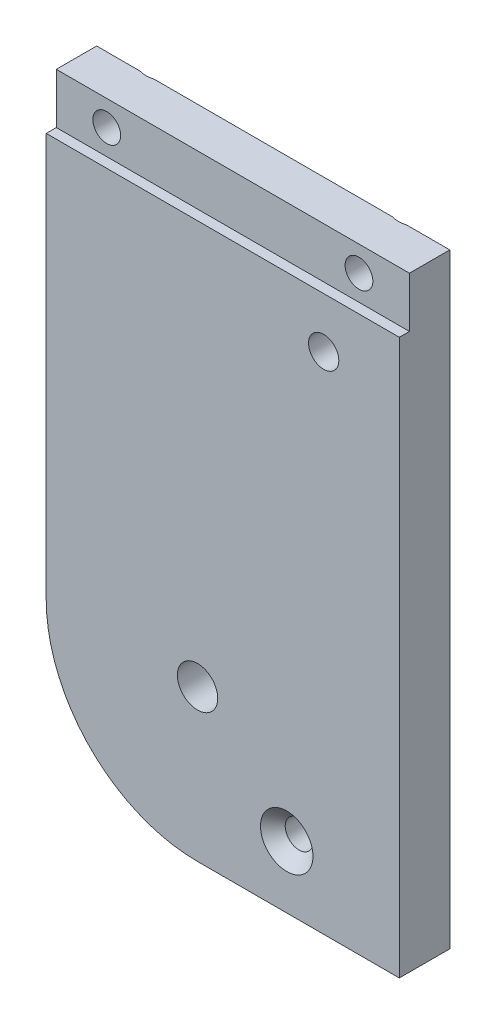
from build123d import *

# Parameters (mm, degrees)
ESQUISSE1_R                                    = 4
BOSS_EXTRU_1_DEPTH                             = 10
ESQUISSE2_W                                    = 2
ESQUISSE2_H                                    = 10
ENL_V_MAT_EXTRU_1_DEPTH                        = 153.397506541
ESQUISSE3_R                                    = 3
ENL_V_MAT_EXTRU_2_DEPTH                        = 158.241851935
FRAISAGE_POUR_VIS_T_TE_FRAIS_E_M51_D           = 5.5
FRAISAGE_POUR_VIS_T_TE_FRAIS_E_M51_CSINK_D     = 10.4
FRAISAGE_POUR_VIS_T_TE_FRAIS_E_M51_CSINK_ANGLE = 90
FRAISAGE_POUR_VIS_T_TE_FRAIS_E_M52_D           = 5.5
FRAISAGE_POUR_VIS_T_TE_FRAIS_E_M52_CSINK_D     = 10.4
FRAISAGE_POUR_VIS_T_TE_FRAIS_E_M52_CSINK_ANGLE = 90


with BuildPart() as part:
    # Esquisse1 → Boss.-Extru.1 (new body)
    with BuildSketch(Plane.XY):
        with BuildLine():
            Line((-80, 135), (-10, 135))
            Line((-10, 135), (-10, 15))
            Line((-10, 15), (-50, 15))
            ThreePointArc((-50, 15), (-71.213203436, 23.786796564), (-80, 45))
            Line((-80, 45), (-80, 135))
        make_face()
        with Locations((-50, 45)):
            Circle(ESQUISSE1_R, mode=Mode.SUBTRACT)
    extrude(amount=BOSS_EXTRU_1_DEPTH)

    # Esquisse2 → Enl_v. mat.-Extru.1 (cut, through all)
    with BuildSketch(Plane(origin=(-10, 0, 0), x_dir=(0, 0, -1), z_dir=(1, 0, 0))):
        with Locations((-9, 130)):
            Rectangle(ESQUISSE2_W, ESQUISSE2_H)
    extrude(amount=-ENL_V_MAT_EXTRU_1_DEPTH, mode=Mode.SUBTRACT)

    # Esquisse3 → Enl_v. mat.-Extru.2 (cut, through all)
    with BuildSketch(Plane.XY.offset(10)):
        with Locations((-25, 115)):
            Circle(ESQUISSE3_R)
    extrude(amount=-ENL_V_MAT_EXTRU_2_DEPTH, mode=Mode.SUBTRACT)

    # Fraisage pour vis _ t_te frais_e M51 (through all)
    with Locations(Plane.XY.offset(10)):
        with Locations((-32.32233047, 27.32233047)):
            CounterSinkHole(FRAISAGE_POUR_VIS_T_TE_FRAIS_E_M51_D / 2, FRAISAGE_POUR_VIS_T_TE_FRAIS_E_M51_CSINK_D / 2, counter_sink_angle=FRAISAGE_POUR_VIS_T_TE_FRAIS_E_M51_CSINK_ANGLE)

    # Fraisage pour vis _ t_te frais_e M52 (through all)
    with Locations(Plane(origin=(0, 0, 0), x_dir=(-1, 0, 0), z_dir=(0, 0, -1))):
        with Locations((20, 130), (70, 130)):
            CounterSinkHole(FRAISAGE_POUR_VIS_T_TE_FRAIS_E_M52_D / 2, FRAISAGE_POUR_VIS_T_TE_FRAIS_E_M52_CSINK_D / 2, counter_sink_angle=FRAISAGE_POUR_VIS_T_TE_FRAIS_E_M52_CSINK_ANGLE)


solid = part.part
